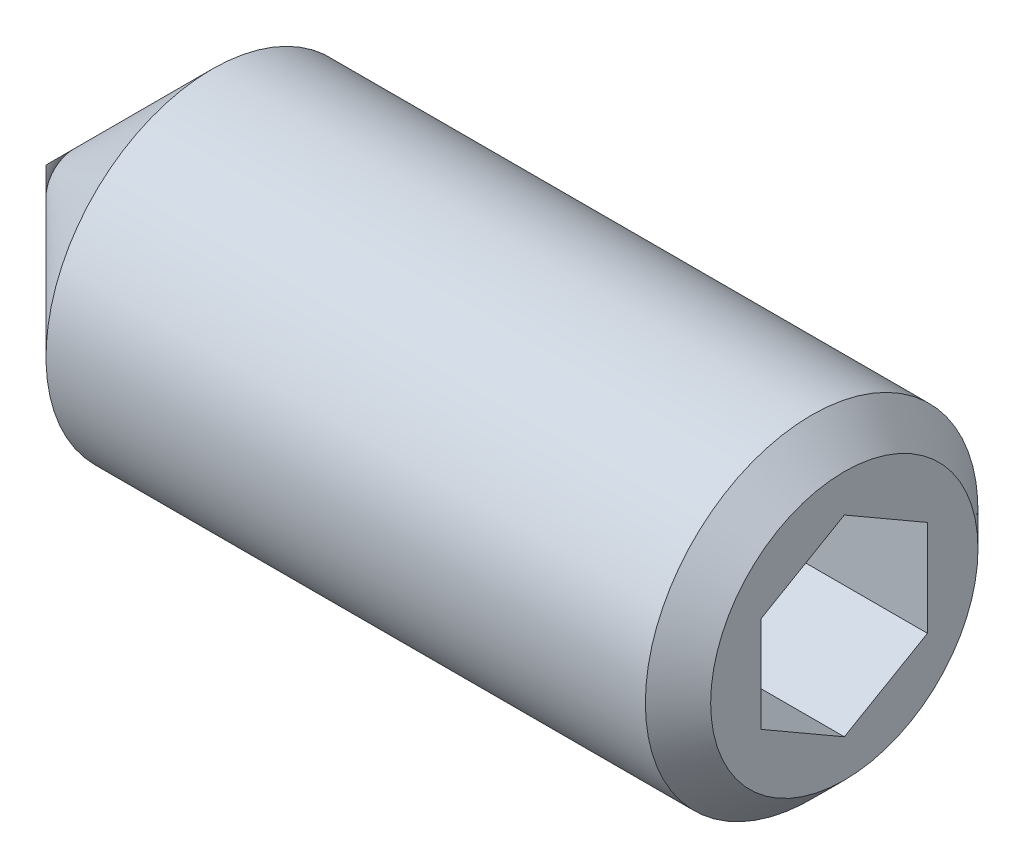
ISO-10303-21;
HEADER;
FILE_DESCRIPTION(('STEP AP214'),'2;1');
FILE_NAME('part.step','',(''),(''),'','','');
FILE_SCHEMA(('AUTOMOTIVE_DESIGN { 1 0 10303 214 1 1 1 1 }'));
ENDSEC;
DATA;
#1=APPLICATION_CONTEXT('core data for automotive mechanical design processes');
#2=APPLICATION_PROTOCOL_DEFINITION('international standard','automotive_design',2000,#1);
#3=PRODUCT_CONTEXT('',#1,'mechanical');
#4=PRODUCT('Part','Part','',(#3));
#5=PRODUCT_RELATED_PRODUCT_CATEGORY('part','',(#4));
#6=PRODUCT_DEFINITION_FORMATION('','',#4);
#7=PRODUCT_DEFINITION_CONTEXT('part definition',#1,'design');
#8=PRODUCT_DEFINITION('design','',#6,#7);
#9=PRODUCT_DEFINITION_SHAPE('','',#8);
#10=(LENGTH_UNIT() NAMED_UNIT(*) SI_UNIT(.MILLI.,.METRE.));
#11=(NAMED_UNIT(*) PLANE_ANGLE_UNIT() SI_UNIT($,.RADIAN.));
#12=(NAMED_UNIT(*) SI_UNIT($,.STERADIAN.) SOLID_ANGLE_UNIT());
#13=UNCERTAINTY_MEASURE_WITH_UNIT(LENGTH_MEASURE(1.E-05),#10,'distance_accuracy_value','');
#14=(GEOMETRIC_REPRESENTATION_CONTEXT(3) GLOBAL_UNCERTAINTY_ASSIGNED_CONTEXT((#13)) GLOBAL_UNIT_ASSIGNED_CONTEXT((#10,
#11,#12)) REPRESENTATION_CONTEXT('',''));
#15=CARTESIAN_POINT('',(0.,0.,0.));
#16=DIRECTION('',(0.,0.,1.));
#17=DIRECTION('',(1.,0.,0.));
#18=AXIS2_PLACEMENT_3D('',#15,#16,#17);
#19=CARTESIAN_POINT('',(12.,-0.721687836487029,-1.25));
#20=DIRECTION('',(0.,0.,-1.));
#21=DIRECTION('',(-1.,0.,0.));
#22=AXIS2_PLACEMENT_3D('',#19,#20,#21);
#23=PLANE('',#22);
#24=DIRECTION('',(1.,0.,0.));
#25=VECTOR('',#24,1.);
#26=CARTESIAN_POINT('',(12.,-0.721687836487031,-1.24999999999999));
#27=LINE('',#26,#25);
#28=CARTESIAN_POINT('',(9.00000000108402,-0.721687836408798,-1.24999999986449));
#29=VERTEX_POINT('',#28);
#30=CARTESIAN_POINT('',(12.,-0.72168783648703,-1.25));
#31=VERTEX_POINT('',#30);
#32=EDGE_CURVE('E76',#29,#31,#27,.T.);
#33=ORIENTED_EDGE('',*,*,#32,.T.);
#34=DIRECTION('',(0.,1.,0.));
#35=VECTOR('',#34,1.);
#36=CARTESIAN_POINT('',(12.,-0.721687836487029,-1.25));
#37=LINE('',#36,#35);
#38=CARTESIAN_POINT('',(12.,0.721687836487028,-1.24999999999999));
#39=VERTEX_POINT('',#38);
#40=EDGE_CURVE('E82',#39,#31,#37,.F.);
#41=ORIENTED_EDGE('',*,*,#40,.F.);
#42=DIRECTION('',(1.,0.,0.));
#43=VECTOR('',#42,1.);
#44=CARTESIAN_POINT('',(12.,0.721687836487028,-1.24999999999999));
#45=LINE('',#44,#43);
#46=CARTESIAN_POINT('',(9.00000000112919,0.721687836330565,-1.25));
#47=VERTEX_POINT('',#46);
#48=EDGE_CURVE('E79',#39,#47,#45,.F.);
#49=ORIENTED_EDGE('',*,*,#48,.T.);
#50=CARTESIAN_POINT('',(9.00000000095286,-0.721687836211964,-1.25000000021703));
#51=CARTESIAN_POINT('',(8.98168471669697,-0.658260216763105,-1.25000000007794));
#52=CARTESIAN_POINT('',(8.96502792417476,-0.594285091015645,-1.25000000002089));
#53=CARTESIAN_POINT('',(8.93595399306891,-0.465227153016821,-1.24999999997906));
#54=CARTESIAN_POINT('',(8.92354713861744,-0.400142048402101,-1.24999999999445));
#55=CARTESIAN_POINT('',(8.9042349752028,-0.270778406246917,-1.2500000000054));
#56=CARTESIAN_POINT('',(8.89720111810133,-0.206519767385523,-1.25000000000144));
#57=CARTESIAN_POINT('',(8.88880573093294,-0.0777002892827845,-1.24999999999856));
#58=CARTESIAN_POINT('',(8.88743724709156,-0.0131399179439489,-1.24999999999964));
#59=CARTESIAN_POINT('',(8.89029143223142,0.107484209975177,-1.25000000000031));
#60=CARTESIAN_POINT('',(8.89381330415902,0.163566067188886,-1.25000000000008));
#61=CARTESIAN_POINT('',(8.90497331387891,0.275364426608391,-1.24999999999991));
#62=CARTESIAN_POINT('',(8.91261526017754,0.331080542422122,-1.24999999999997));
#63=CARTESIAN_POINT('',(8.93171864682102,0.443109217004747,-1.25000000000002));
#64=CARTESIAN_POINT('',(8.94326102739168,0.499407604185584,-1.25000000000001));
#65=CARTESIAN_POINT('',(8.96945735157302,0.611164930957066,-1.24999999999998));
#66=CARTESIAN_POINT('',(8.98410514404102,0.666625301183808,-1.24999999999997));
#67=CARTESIAN_POINT('',(9.00000000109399,0.72168783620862,-1.25));
#68=B_SPLINE_CURVE_WITH_KNOTS('',3,(#50,#51,#52,#53,#54,#55,#56,#57,#58,#59,#60,#61,#62,#63,#64,
#65,#66,#67),.UNSPECIFIED.,.F.,.F.,(4,2,2,2,2,2,2,2,4),(0.,0.198135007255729,0.396746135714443,
0.590442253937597,0.783900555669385,0.952317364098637,1.12089012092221,1.2932010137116,
1.46517373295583),.UNSPECIFIED.);
#69=EDGE_CURVE('E19',#29,#47,#68,.T.);
#70=ORIENTED_EDGE('',*,*,#69,.F.);
#71=EDGE_LOOP('',(#33,#41,#49,#70));
#72=FACE_BOUND('',#71,.T.);
#73=ADVANCED_FACE('F15',(#72),#23,.F.);
#74=CARTESIAN_POINT('',(12.,-1.44337567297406,0.));
#75=DIRECTION('',(0.,-0.866025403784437,-0.500000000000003));
#76=DIRECTION('',(0.,0.500000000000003,-0.866025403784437));
#77=AXIS2_PLACEMENT_3D('',#74,#75,#76);
#78=PLANE('',#77);
#79=DIRECTION('',(1.,0.,0.));
#80=VECTOR('',#79,1.);
#81=CARTESIAN_POINT('',(12.,-1.44337567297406,0.));
#82=LINE('',#81,#80);
#83=CARTESIAN_POINT('',(9.00000000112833,-1.44337567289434,-1.38083086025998E-10));
#84=VERTEX_POINT('',#83);
#85=CARTESIAN_POINT('',(12.,-1.44337567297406,0.));
#86=VERTEX_POINT('',#85);
#87=EDGE_CURVE('E143',#84,#86,#82,.T.);
#88=ORIENTED_EDGE('',*,*,#87,.T.);
#89=DIRECTION('',(0.,0.500000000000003,-0.866025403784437));
#90=VECTOR('',#89,1.);
#91=CARTESIAN_POINT('',(12.,-1.44337567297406,0.));
#92=LINE('',#91,#90);
#93=EDGE_CURVE('E92',#31,#86,#92,.F.);
#94=ORIENTED_EDGE('',*,*,#93,.F.);
#95=ORIENTED_EDGE('',*,*,#32,.F.);
#96=CARTESIAN_POINT('',(9.00000000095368,-1.44337567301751,-3.50428935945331E-10));
#97=CARTESIAN_POINT('',(8.98168471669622,-1.4116618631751,-0.0549299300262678));
#98=CARTESIAN_POINT('',(8.96502792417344,-1.37967430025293,-0.110334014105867));
#99=CARTESIAN_POINT('',(8.93595399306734,-1.31514533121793,-0.22210146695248));
#100=CARTESIAN_POINT('',(8.9235471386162,-1.28260277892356,-0.278466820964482));
#101=CARTESIAN_POINT('',(8.90423497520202,-1.21792095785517,-0.390499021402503));
#102=CARTESIAN_POINT('',(8.89720111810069,-1.18579163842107,-0.446148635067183));
#103=CARTESIAN_POINT('',(8.88880573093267,-1.1213818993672,-0.5577095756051));
#104=CARTESIAN_POINT('',(8.88743724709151,-1.08910171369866,-0.613620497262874));
#105=CARTESIAN_POINT('',(8.89029143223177,-1.02878964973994,-0.718084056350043));
#106=CARTESIAN_POINT('',(8.89381330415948,-1.00074872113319,-0.766652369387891));
#107=CARTESIAN_POINT('',(8.90497331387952,-0.944849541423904,-0.863472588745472));
#108=CARTESIAN_POINT('',(8.91261526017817,-0.916991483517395,-0.91172416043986));
#109=CARTESIAN_POINT('',(8.9317186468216,-0.860977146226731,-1.00874383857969));
#110=CARTESIAN_POINT('',(8.94326102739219,-0.832827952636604,-1.05749967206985));
#111=CARTESIAN_POINT('',(8.96945735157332,-0.776949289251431,-1.15428435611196));
#112=CARTESIAN_POINT('',(8.98410514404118,-0.749219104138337,-1.20231444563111));
#113=CARTESIAN_POINT('',(9.00000000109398,-0.721687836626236,-1.24999999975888));
#114=B_SPLINE_CURVE_WITH_KNOTS('',3,(#96,#97,#98,#99,#100,#101,#102,#103,#104,#105,#106,#107,
#108,#109,#110,#111,#112,#113),.UNSPECIFIED.,.F.,.F.,(4,2,2,2,2,2,2,2,4),(0.,0.19813500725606,
0.396746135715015,0.590442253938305,0.783900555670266,0.952317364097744,1.12089012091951,
1.29320101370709,1.46517373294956),.UNSPECIFIED.);
#115=EDGE_CURVE('E84',#84,#29,#114,.T.);
#116=ORIENTED_EDGE('',*,*,#115,.F.);
#117=EDGE_LOOP('',(#88,#94,#95,#116));
#118=FACE_BOUND('',#117,.T.);
#119=ADVANCED_FACE('F93',(#118),#78,.F.);
#120=CARTESIAN_POINT('',(12.,0.721687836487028,-1.24999999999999));
#121=DIRECTION('',(0.,0.86602540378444,-0.499999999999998));
#122=DIRECTION('',(0.,0.499999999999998,0.86602540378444));
#123=AXIS2_PLACEMENT_3D('',#120,#121,#122);
#124=PLANE('',#123);
#125=ORIENTED_EDGE('',*,*,#48,.F.);
#126=DIRECTION('',(0.,0.499999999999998,0.86602540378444));
#127=VECTOR('',#126,1.);
#128=CARTESIAN_POINT('',(12.,0.721687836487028,-1.24999999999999));
#129=LINE('',#128,#127);
#130=CARTESIAN_POINT('',(12.,1.44337567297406,0.));
#131=VERTEX_POINT('',#130);
#132=EDGE_CURVE('E91',#131,#39,#129,.F.);
#133=ORIENTED_EDGE('',*,*,#132,.F.);
#134=DIRECTION('',(1.,0.,0.));
#135=VECTOR('',#134,1.);
#136=CARTESIAN_POINT('',(12.,1.44337567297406,0.));
#137=LINE('',#136,#135);
#138=CARTESIAN_POINT('',(9.00000000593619,1.4433756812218,1.42855084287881E-08));
#139=VERTEX_POINT('',#138);
#140=EDGE_CURVE('E188',#131,#139,#137,.F.);
#141=ORIENTED_EDGE('',*,*,#140,.T.);
#142=CARTESIAN_POINT('',(9.00000000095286,0.721687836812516,-1.24999999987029));
#143=CARTESIAN_POINT('',(8.98168471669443,0.753401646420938,-1.19507007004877));
#144=CARTESIAN_POINT('',(8.96502792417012,0.785389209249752,-1.13966598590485));
#145=CARTESIAN_POINT('',(8.93595399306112,0.849918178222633,-1.02789853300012));
#146=CARTESIAN_POINT('',(8.92354713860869,0.882460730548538,-0.971533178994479));
#147=CARTESIAN_POINT('',(8.90423497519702,0.947142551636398,-0.859500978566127));
#148=CARTESIAN_POINT('',(8.89720111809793,0.979271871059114,-0.803851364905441));
#149=CARTESIAN_POINT('',(8.88880573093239,1.04368161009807,-0.69229042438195));
#150=CARTESIAN_POINT('',(8.88743724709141,1.07596179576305,-0.636379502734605));
#151=CARTESIAN_POINT('',(8.89029143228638,1.13627386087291,-0.531915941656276));
#152=CARTESIAN_POINT('',(8.89381330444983,1.16431479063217,-0.483347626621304));
#153=CARTESIAN_POINT('',(8.90497331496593,1.22021397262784,-0.38652740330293));
#154=CARTESIAN_POINT('',(8.91261526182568,1.24807203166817,-0.338275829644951));
#155=CARTESIAN_POINT('',(8.93171864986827,1.30408637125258,-0.241256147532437));
#156=CARTESIAN_POINT('',(8.94326103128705,1.3322355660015,-0.192500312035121));
#157=CARTESIAN_POINT('',(8.96945735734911,1.38811423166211,-0.0957156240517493));
#158=CARTESIAN_POINT('',(8.98410515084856,1.41584441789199,-0.0476855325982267));
#159=CARTESIAN_POINT('',(9.00000000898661,1.44337568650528,2.34367677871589E-08));
#160=B_SPLINE_CURVE_WITH_KNOTS('',3,(#142,#143,#144,#145,#146,#147,#148,#149,#150,#151,#152,
#153,#154,#155,#156,#157,#158,#159),.UNSPECIFIED.,.F.,.F.,(4,2,2,2,2,2,2,2,4),(0.,
0.19813500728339,0.396746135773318,0.590442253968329,0.783900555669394,0.952317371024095,
1.12089013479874,1.29320103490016,1.46517376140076),.UNSPECIFIED.);
#161=EDGE_CURVE('E138',#47,#139,#160,.T.);
#162=ORIENTED_EDGE('',*,*,#161,.F.);
#163=EDGE_LOOP('',(#125,#133,#141,#162));
#164=FACE_BOUND('',#163,.T.);
#165=ADVANCED_FACE('F144',(#164),#124,.F.);
#166=CARTESIAN_POINT('',(12.,-0.721687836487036,1.24999999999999));
#167=DIRECTION('',(0.,-0.86602540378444,0.499999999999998));
#168=DIRECTION('',(0.,-0.499999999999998,-0.86602540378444));
#169=AXIS2_PLACEMENT_3D('',#166,#167,#168);
#170=PLANE('',#169);
#171=DIRECTION('',(1.,0.,0.));
#172=VECTOR('',#171,1.);
#173=CARTESIAN_POINT('',(12.,-0.721687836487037,1.25));
#174=LINE('',#173,#172);
#175=CARTESIAN_POINT('',(8.99999999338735,-0.721687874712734,1.24999996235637));
#176=VERTEX_POINT('',#175);
#177=CARTESIAN_POINT('',(12.,-0.721687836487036,1.25));
#178=VERTEX_POINT('',#177);
#179=EDGE_CURVE('E196',#176,#178,#174,.T.);
#180=ORIENTED_EDGE('',*,*,#179,.T.);
#181=DIRECTION('',(0.,-0.499999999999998,-0.86602540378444));
#182=VECTOR('',#181,1.);
#183=CARTESIAN_POINT('',(12.,-0.721687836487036,1.24999999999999));
#184=LINE('',#183,#182);
#185=EDGE_CURVE('E189',#86,#178,#184,.F.);
#186=ORIENTED_EDGE('',*,*,#185,.F.);
#187=ORIENTED_EDGE('',*,*,#87,.F.);
#188=CARTESIAN_POINT('',(9.00000000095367,-1.4433756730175,3.50427462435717E-10));
#189=CARTESIAN_POINT('',(8.98168471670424,-1.41166186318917,0.0549299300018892));
#190=CARTESIAN_POINT('',(8.96502792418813,-1.37967430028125,0.110334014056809));
#191=CARTESIAN_POINT('',(8.93595399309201,-1.31514533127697,0.222101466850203));
#192=CARTESIAN_POINT('',(8.92354713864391,-1.28260277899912,0.278466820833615));
#193=CARTESIAN_POINT('',(8.90423497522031,-1.21792095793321,0.390499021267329));
#194=CARTESIAN_POINT('',(8.89720111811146,-1.18579163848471,0.446148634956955));
#195=CARTESIAN_POINT('',(8.8888057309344,-1.12138189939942,0.557709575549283));
#196=CARTESIAN_POINT('',(8.88743724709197,-1.08910171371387,0.613620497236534));
#197=CARTESIAN_POINT('',(8.89029143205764,-1.02878965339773,0.718084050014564));
#198=CARTESIAN_POINT('',(8.89381330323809,-1.00074872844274,0.766652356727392));
#199=CARTESIAN_POINT('',(8.90497331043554,-0.944849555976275,0.863472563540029));
#200=CARTESIAN_POINT('',(8.91261525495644,-0.916991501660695,0.911724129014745));
#201=CARTESIAN_POINT('',(8.93171863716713,-0.860977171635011,1.00874379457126));
#202=CARTESIAN_POINT('',(8.94326101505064,-0.832827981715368,1.05749962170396));
#203=CARTESIAN_POINT('',(8.96945733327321,-0.776949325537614,1.15428429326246));
#204=CARTESIAN_POINT('',(8.98410512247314,-0.749219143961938,1.20231437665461));
#205=CARTESIAN_POINT('',(8.99999997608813,-0.72168787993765,1.24999992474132));
#206=B_SPLINE_CURVE_WITH_KNOTS('',3,(#188,#189,#190,#191,#192,#193,#194,#195,#196,#197,#198,
#199,#200,#201,#202,#203,#204,#205),.UNSPECIFIED.,.F.,.F.,(4,2,2,2,2,2,2,2,4),(0.,
0.198135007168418,0.396746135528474,0.590442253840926,0.78390055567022,0.952317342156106,
1.1208900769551,1.29320094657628,1.46517364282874),.UNSPECIFIED.);
#207=EDGE_CURVE('E87',#84,#176,#206,.T.);
#208=ORIENTED_EDGE('',*,*,#207,.T.);
#209=EDGE_LOOP('',(#180,#186,#187,#208));
#210=FACE_BOUND('',#209,.T.);
#211=ADVANCED_FACE('F147',(#210),#170,.F.);
#212=CARTESIAN_POINT('',(12.,1.44337567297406,0.));
#213=DIRECTION('',(0.,0.866025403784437,0.500000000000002));
#214=DIRECTION('',(0.,-0.500000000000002,0.866025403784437));
#215=AXIS2_PLACEMENT_3D('',#212,#213,#214);
#216=PLANE('',#215);
#217=ORIENTED_EDGE('',*,*,#140,.F.);
#218=DIRECTION('',(0.,-0.500000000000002,0.866025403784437));
#219=VECTOR('',#218,1.);
#220=CARTESIAN_POINT('',(12.,1.44337567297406,0.));
#221=LINE('',#220,#219);
#222=CARTESIAN_POINT('',(12.,0.721687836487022,1.25));
#223=VERTEX_POINT('',#222);
#224=EDGE_CURVE('E179',#223,#131,#221,.F.);
#225=ORIENTED_EDGE('',*,*,#224,.F.);
#226=DIRECTION('',(1.,0.,0.));
#227=VECTOR('',#226,1.);
#228=CARTESIAN_POINT('',(12.,0.721687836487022,1.25));
#229=LINE('',#228,#227);
#230=CARTESIAN_POINT('',(8.9999999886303,0.721687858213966,1.24999996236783));
#231=VERTEX_POINT('',#230);
#232=EDGE_CURVE('E110',#223,#231,#229,.F.);
#233=ORIENTED_EDGE('',*,*,#232,.T.);
#234=CARTESIAN_POINT('',(8.99999997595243,0.721687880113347,1.24999992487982));
#235=CARTESIAN_POINT('',(8.98168469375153,0.753401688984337,1.19506999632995));
#236=CARTESIAN_POINT('',(8.96502790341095,0.785389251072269,1.13966591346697));
#237=CARTESIAN_POINT('',(8.93595397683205,0.849918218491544,1.02789846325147));
#238=CARTESIAN_POINT('',(8.92354712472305,0.882460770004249,0.971533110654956));
#239=CARTESIAN_POINT('',(8.90423496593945,0.947142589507,0.859500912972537));
#240=CARTESIAN_POINT('',(8.89720111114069,0.979271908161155,0.80385130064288));
#241=CARTESIAN_POINT('',(8.88880572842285,1.04368164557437,0.692290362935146));
#242=CARTESIAN_POINT('',(8.8874372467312,1.07596183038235,0.636379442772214));
#243=CARTESIAN_POINT('',(8.89029143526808,1.13627388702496,0.531915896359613));
#244=CARTESIAN_POINT('',(8.89381330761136,1.16431480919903,0.483347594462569));
#245=CARTESIAN_POINT('',(8.90497331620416,1.22021397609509,0.386527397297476));
#246=CARTESIAN_POINT('',(8.91261526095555,1.24807202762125,0.338275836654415));
#247=CARTESIAN_POINT('',(8.93171864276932,1.30408635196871,0.241256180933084));
#248=CARTESIAN_POINT('',(8.9432610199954,1.33223553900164,0.19250035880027));
#249=CARTESIAN_POINT('',(8.96945733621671,1.38811418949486,0.0957156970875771));
#250=CARTESIAN_POINT('',(8.98410512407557,1.41584436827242,0.0476856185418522));
#251=CARTESIAN_POINT('',(8.99999997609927,1.44337562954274,7.5225243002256E-08));
#252=B_SPLINE_CURVE_WITH_KNOTS('',3,(#234,#235,#236,#237,#238,#239,#240,#241,#242,#243,#244,
#245,#246,#247,#248,#249,#250,#251),.UNSPECIFIED.,.F.,.F.,(4,2,2,2,2,2,2,2,4),(0.,
0.198135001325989,0.396746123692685,0.590442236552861,0.783900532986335,0.952317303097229,
1.12089002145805,1.29320087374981,1.46517355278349),.UNSPECIFIED.);
#253=EDGE_CURVE('E134',#231,#139,#252,.T.);
#254=ORIENTED_EDGE('',*,*,#253,.T.);
#255=EDGE_LOOP('',(#217,#225,#233,#254));
#256=FACE_BOUND('',#255,.T.);
#257=ADVANCED_FACE('F122',(#256),#216,.F.);
#258=CARTESIAN_POINT('',(9.00500000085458,0.,0.));
#259=DIRECTION('',(1.,0.,0.));
#260=DIRECTION('',(0.,0.,-1.));
#261=AXIS2_PLACEMENT_3D('',#258,#259,#260);
#262=CONICAL_SURFACE('',#261,1.45203592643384,1.04719754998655);
#263=CARTESIAN_POINT('',(8.16666666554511,-5.6843418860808E-11,0.));
#264=VERTEX_POINT('',#263);
#265=VERTEX_LOOP('',#264);
#266=FACE_BOUND('',#265,.T.);
#267=ORIENTED_EDGE('',*,*,#207,.F.);
#268=ORIENTED_EDGE('',*,*,#115,.T.);
#269=ORIENTED_EDGE('',*,*,#69,.T.);
#270=ORIENTED_EDGE('',*,*,#161,.T.);
#271=ORIENTED_EDGE('',*,*,#253,.F.);
#272=CARTESIAN_POINT('',(9.00000003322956,0.721687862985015,1.24999996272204));
#273=CARTESIAN_POINT('',(8.98168473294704,0.658260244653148,1.24999998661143));
#274=CARTESIAN_POINT('',(8.96502793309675,0.594285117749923,1.24999999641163));
#275=CARTESIAN_POINT('',(8.93595399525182,0.465227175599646,1.25000000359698));
#276=CARTESIAN_POINT('',(8.92354714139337,0.400142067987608,1.25000000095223));
#277=CARTESIAN_POINT('',(8.90423497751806,0.270778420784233,1.24999999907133));
#278=CARTESIAN_POINT('',(8.89720111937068,0.206519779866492,1.24999999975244));
#279=CARTESIAN_POINT('',(8.8888057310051,0.0777002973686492,1.25000000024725));
#280=CARTESIAN_POINT('',(8.88743724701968,0.0131399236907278,1.250000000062));
#281=CARTESIAN_POINT('',(8.89029143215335,-0.107484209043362,1.24999999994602));
#282=CARTESIAN_POINT('',(8.89381330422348,-0.163566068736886,1.24999999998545));
#283=CARTESIAN_POINT('',(8.90497331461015,-0.275364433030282,1.25000000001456));
#284=CARTESIAN_POINT('',(8.91261526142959,-0.33108055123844,1.2500000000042));
#285=CARTESIAN_POINT('',(8.93171864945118,-0.443109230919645,1.2499999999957));
#286=CARTESIAN_POINT('',(8.94326103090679,-0.499407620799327,1.24999999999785));
#287=CARTESIAN_POINT('',(8.96945735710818,-0.611164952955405,1.25000000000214));
#288=CARTESIAN_POINT('',(8.9841051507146,-0.666625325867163,1.25000000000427));
#289=CARTESIAN_POINT('',(9.00000000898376,-0.7216878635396,1.25));
#290=B_SPLINE_CURVE_WITH_KNOTS('',3,(#272,#273,#274,#275,#276,#277,#278,#279,#280,#281,#282,
#283,#284,#285,#286,#287,#288,#289),.UNSPECIFIED.,.F.,.F.,(4,2,2,2,2,2,2,2,4),(0.,
0.198135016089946,0.396746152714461,0.590442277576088,0.783900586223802,0.952317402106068,
1.12089016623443,1.2932010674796,1.46517379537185),.UNSPECIFIED.);
#291=EDGE_CURVE('E104',#231,#176,#290,.T.);
#292=ORIENTED_EDGE('',*,*,#291,.T.);
#293=EDGE_LOOP('',(#267,#268,#269,#270,#271,#292));
#294=FACE_BOUND('',#293,.T.);
#295=ADVANCED_FACE('F85',(#266,#294),#262,.F.);
#296=CARTESIAN_POINT('',(12.,0.721687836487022,1.25));
#297=DIRECTION('',(0.,0.,1.));
#298=DIRECTION('',(1.,0.,0.));
#299=AXIS2_PLACEMENT_3D('',#296,#297,#298);
#300=PLANE('',#299);
#301=ORIENTED_EDGE('',*,*,#232,.F.);
#302=DIRECTION('',(0.,1.,0.));
#303=VECTOR('',#302,1.);
#304=CARTESIAN_POINT('',(12.,0.,1.25));
#305=LINE('',#304,#303);
#306=EDGE_CURVE('E103',#223,#178,#305,.F.);
#307=ORIENTED_EDGE('',*,*,#306,.T.);
#308=ORIENTED_EDGE('',*,*,#179,.F.);
#309=ORIENTED_EDGE('',*,*,#291,.F.);
#310=EDGE_LOOP('',(#301,#307,#308,#309));
#311=FACE_BOUND('',#310,.T.);
#312=ADVANCED_FACE('F116',(#311),#300,.F.);
#313=CARTESIAN_POINT('',(12.,0.,0.));
#314=DIRECTION('',(-1.,0.,0.));
#315=DIRECTION('',(0.,0.,1.));
#316=AXIS2_PLACEMENT_3D('',#313,#314,#315);
#317=PLANE('',#316);
#318=ORIENTED_EDGE('',*,*,#224,.T.);
#319=ORIENTED_EDGE('',*,*,#132,.T.);
#320=ORIENTED_EDGE('',*,*,#40,.T.);
#321=ORIENTED_EDGE('',*,*,#93,.T.);
#322=ORIENTED_EDGE('',*,*,#185,.T.);
#323=ORIENTED_EDGE('',*,*,#306,.F.);
#324=EDGE_LOOP('',(#318,#319,#320,#321,#322,#323));
#325=FACE_BOUND('',#324,.T.);
#326=CARTESIAN_POINT('',(12.0000000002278,0.,0.));
#327=DIRECTION('',(-1.,0.,0.));
#328=DIRECTION('',(0.,0.,1.));
#329=AXIS2_PLACEMENT_3D('',#326,#327,#328);
#330=CIRCLE('',#329,2.00924000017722);
#331=CARTESIAN_POINT('',(12.0000000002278,0.,2.00924000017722));
#332=VERTEX_POINT('',#331);
#333=EDGE_CURVE('E100',#332,#332,#330,.T.);
#334=ORIENTED_EDGE('',*,*,#333,.F.);
#335=EDGE_LOOP('',(#334));
#336=FACE_BOUND('',#335,.T.);
#337=ADVANCED_FACE('F170',(#325,#336),#317,.F.);
#338=CARTESIAN_POINT('',(2.49999499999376,0.,0.));
#339=DIRECTION('',(1.,0.,0.));
#340=DIRECTION('',(0.,0.,-1.));
#341=AXIS2_PLACEMENT_3D('',#338,#339,#340);
#342=CONICAL_SURFACE('',#341,2.49999999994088,0.785399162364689);
#343=CARTESIAN_POINT('',(-4.60431692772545E-09,-1.70530256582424E-10,0.));
#344=VERTEX_POINT('',#343);
#345=VERTEX_LOOP('',#344);
#346=FACE_BOUND('',#345,.T.);
#347=CARTESIAN_POINT('',(2.499995,0.,0.));
#348=DIRECTION('',(1.,0.,0.));
#349=DIRECTION('',(0.,1.,0.));
#350=AXIS2_PLACEMENT_3D('',#347,#348,#349);
#351=CIRCLE('',#350,2.5);
#352=CARTESIAN_POINT('',(2.499995,2.5,0.));
#353=VERTEX_POINT('',#352);
#354=EDGE_CURVE('E29',#353,#353,#351,.T.);
#355=ORIENTED_EDGE('',*,*,#354,.F.);
#356=EDGE_LOOP('',(#355));
#357=FACE_BOUND('',#356,.T.);
#358=ADVANCED_FACE('F164',(#346,#357),#342,.T.);
#359=CARTESIAN_POINT('',(11.509239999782,0.,0.));
#360=DIRECTION('',(-1.,0.,0.));
#361=DIRECTION('',(0.,0.,1.));
#362=AXIS2_PLACEMENT_3D('',#359,#360,#361);
#363=CONICAL_SURFACE('',#362,2.49999999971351,0.78539816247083);
#364=ORIENTED_EDGE('',*,*,#333,.T.);
#365=EDGE_LOOP('',(#364));
#366=FACE_BOUND('',#365,.T.);
#367=CARTESIAN_POINT('',(11.50924,0.,0.));
#368=DIRECTION('',(1.,0.,0.));
#369=DIRECTION('',(0.,1.,0.));
#370=AXIS2_PLACEMENT_3D('',#367,#368,#369);
#371=CIRCLE('',#370,2.5);
#372=CARTESIAN_POINT('',(11.50924,2.5,0.));
#373=VERTEX_POINT('',#372);
#374=EDGE_CURVE('E10',#373,#373,#371,.F.);
#375=ORIENTED_EDGE('',*,*,#374,.F.);
#376=EDGE_LOOP('',(#375));
#377=FACE_BOUND('',#376,.T.);
#378=ADVANCED_FACE('F158',(#366,#377),#363,.T.);
#379=CARTESIAN_POINT('',(6.,0.,0.));
#380=DIRECTION('',(1.,0.,0.));
#381=DIRECTION('',(0.,1.,0.));
#382=AXIS2_PLACEMENT_3D('',#379,#380,#381);
#383=CYLINDRICAL_SURFACE('',#382,2.5);
#384=ORIENTED_EDGE('',*,*,#374,.T.);
#385=EDGE_LOOP('',(#384));
#386=FACE_BOUND('',#385,.T.);
#387=ORIENTED_EDGE('',*,*,#354,.T.);
#388=EDGE_LOOP('',(#387));
#389=FACE_BOUND('',#388,.T.);
#390=ADVANCED_FACE('F156',(#386,#389),#383,.T.);
#391=CLOSED_SHELL('',(#73,#119,#165,#211,#257,#295,#312,#337,#358,#378,#390));
#392=MANIFOLD_SOLID_BREP('B1',#391);
#393=ADVANCED_BREP_SHAPE_REPRESENTATION('',(#18,#392),#14);
#394=SHAPE_DEFINITION_REPRESENTATION(#9,#393);
ENDSEC;
END-ISO-10303-21;
